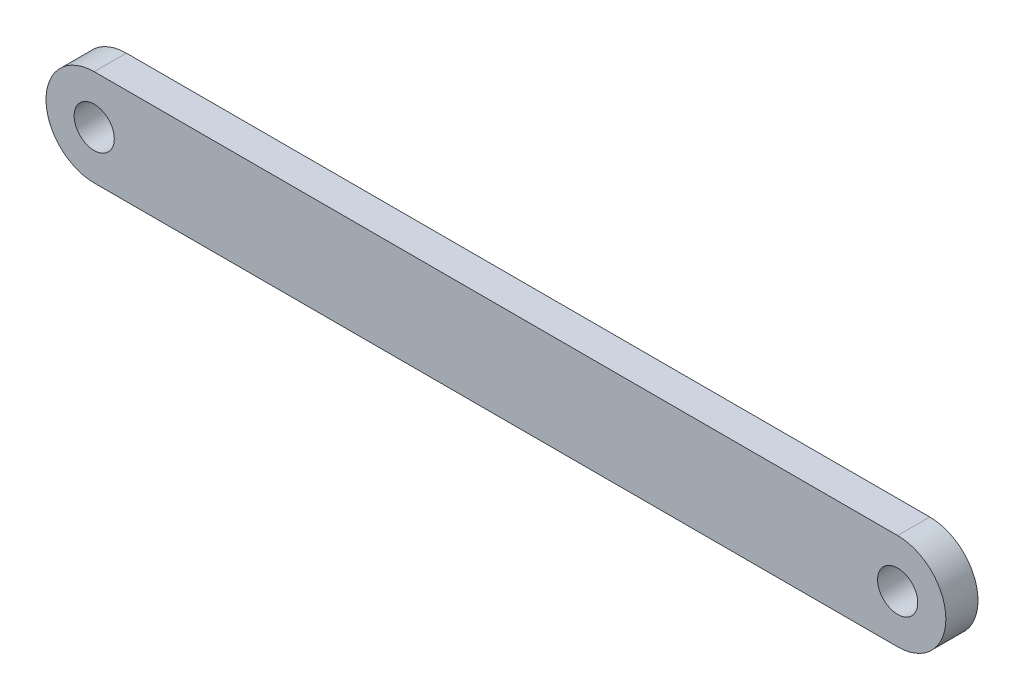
ISO-10303-21;
HEADER;
FILE_DESCRIPTION(('STEP AP214'),'2;1');
FILE_NAME('part.step','',(''),(''),'','','');
FILE_SCHEMA(('AUTOMOTIVE_DESIGN { 1 0 10303 214 1 1 1 1 }'));
ENDSEC;
DATA;
#1=APPLICATION_CONTEXT('core data for automotive mechanical design processes');
#2=APPLICATION_PROTOCOL_DEFINITION('international standard','automotive_design',2000,#1);
#3=PRODUCT_CONTEXT('',#1,'mechanical');
#4=PRODUCT('Part','Part','',(#3));
#5=PRODUCT_RELATED_PRODUCT_CATEGORY('part','',(#4));
#6=PRODUCT_DEFINITION_FORMATION('','',#4);
#7=PRODUCT_DEFINITION_CONTEXT('part definition',#1,'design');
#8=PRODUCT_DEFINITION('design','',#6,#7);
#9=PRODUCT_DEFINITION_SHAPE('','',#8);
#10=(LENGTH_UNIT() NAMED_UNIT(*) SI_UNIT(.MILLI.,.METRE.));
#11=(NAMED_UNIT(*) PLANE_ANGLE_UNIT() SI_UNIT($,.RADIAN.));
#12=(NAMED_UNIT(*) SI_UNIT($,.STERADIAN.) SOLID_ANGLE_UNIT());
#13=UNCERTAINTY_MEASURE_WITH_UNIT(LENGTH_MEASURE(1.E-05),#10,'distance_accuracy_value','');
#14=(GEOMETRIC_REPRESENTATION_CONTEXT(3) GLOBAL_UNCERTAINTY_ASSIGNED_CONTEXT((#13)) GLOBAL_UNIT_ASSIGNED_CONTEXT((#10,
#11,#12)) REPRESENTATION_CONTEXT('',''));
#15=CARTESIAN_POINT('',(0.,0.,0.));
#16=DIRECTION('',(0.,0.,1.));
#17=DIRECTION('',(1.,0.,0.));
#18=AXIS2_PLACEMENT_3D('',#15,#16,#17);
#19=CARTESIAN_POINT('',(-50.,0.,4.));
#20=DIRECTION('',(0.,0.,1.));
#21=DIRECTION('',(1.,0.,0.));
#22=AXIS2_PLACEMENT_3D('',#19,#20,#21);
#23=PLANE('',#22);
#24=CARTESIAN_POINT('',(-50.,0.,4.));
#25=DIRECTION('',(0.,0.,1.));
#26=DIRECTION('',(1.,0.,0.));
#27=AXIS2_PLACEMENT_3D('',#24,#25,#26);
#28=CIRCLE('',#27,2.49999999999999);
#29=CARTESIAN_POINT('',(-47.5,0.,4.));
#30=VERTEX_POINT('',#29);
#31=EDGE_CURVE('E102',#30,#30,#28,.T.);
#32=ORIENTED_EDGE('',*,*,#31,.F.);
#33=EDGE_LOOP('',(#32));
#34=FACE_BOUND('',#33,.T.);
#35=CARTESIAN_POINT('',(-50.,0.,4.));
#36=DIRECTION('',(0.,0.,1.));
#37=DIRECTION('',(1.,0.,0.));
#38=AXIS2_PLACEMENT_3D('',#35,#36,#37);
#39=CIRCLE('',#38,6.);
#40=CARTESIAN_POINT('',(-50.,6.,4.));
#41=VERTEX_POINT('',#40);
#42=CARTESIAN_POINT('',(-50.,-6.,4.));
#43=VERTEX_POINT('',#42);
#44=EDGE_CURVE('E87',#41,#43,#39,.T.);
#45=ORIENTED_EDGE('',*,*,#44,.T.);
#46=DIRECTION('',(1.,0.,0.));
#47=VECTOR('',#46,1.);
#48=CARTESIAN_POINT('',(-50.,-6.,4.));
#49=LINE('',#48,#47);
#50=CARTESIAN_POINT('',(50.,-5.99999999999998,4.));
#51=VERTEX_POINT('',#50);
#52=EDGE_CURVE('E82',#43,#51,#49,.T.);
#53=ORIENTED_EDGE('',*,*,#52,.T.);
#54=CARTESIAN_POINT('',(50.,0.,4.));
#55=DIRECTION('',(0.,0.,1.));
#56=DIRECTION('',(1.,0.,0.));
#57=AXIS2_PLACEMENT_3D('',#54,#55,#56);
#58=CIRCLE('',#57,6.);
#59=CARTESIAN_POINT('',(50.,6.00000000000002,4.));
#60=VERTEX_POINT('',#59);
#61=EDGE_CURVE('E85',#51,#60,#58,.T.);
#62=ORIENTED_EDGE('',*,*,#61,.T.);
#63=DIRECTION('',(-1.,0.,0.));
#64=VECTOR('',#63,1.);
#65=CARTESIAN_POINT('',(-50.,6.,4.));
#66=LINE('',#65,#64);
#67=EDGE_CURVE('E52',#60,#41,#66,.T.);
#68=ORIENTED_EDGE('',*,*,#67,.T.);
#69=EDGE_LOOP('',(#45,#53,#62,#68));
#70=FACE_BOUND('',#69,.T.);
#71=CARTESIAN_POINT('',(50.,0.,4.));
#72=DIRECTION('',(0.,0.,1.));
#73=DIRECTION('',(1.,0.,0.));
#74=AXIS2_PLACEMENT_3D('',#71,#72,#73);
#75=CIRCLE('',#74,2.5);
#76=CARTESIAN_POINT('',(52.5,0.,4.));
#77=VERTEX_POINT('',#76);
#78=EDGE_CURVE('E117',#77,#77,#75,.T.);
#79=ORIENTED_EDGE('',*,*,#78,.F.);
#80=EDGE_LOOP('',(#79));
#81=FACE_BOUND('',#80,.T.);
#82=ADVANCED_FACE('F35',(#34,#70,#81),#23,.T.);
#83=CARTESIAN_POINT('',(-50.,0.,0.));
#84=DIRECTION('',(0.,0.,1.));
#85=DIRECTION('',(1.,0.,0.));
#86=AXIS2_PLACEMENT_3D('',#83,#84,#85);
#87=PLANE('',#86);
#88=CARTESIAN_POINT('',(-50.,0.,0.));
#89=DIRECTION('',(0.,0.,1.));
#90=DIRECTION('',(1.,0.,0.));
#91=AXIS2_PLACEMENT_3D('',#88,#89,#90);
#92=CIRCLE('',#91,2.49999999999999);
#93=CARTESIAN_POINT('',(-47.5,0.,0.));
#94=VERTEX_POINT('',#93);
#95=EDGE_CURVE('E114',#94,#94,#92,.T.);
#96=ORIENTED_EDGE('',*,*,#95,.T.);
#97=EDGE_LOOP('',(#96));
#98=FACE_BOUND('',#97,.T.);
#99=CARTESIAN_POINT('',(-50.,0.,0.));
#100=DIRECTION('',(0.,0.,1.));
#101=DIRECTION('',(1.,0.,0.));
#102=AXIS2_PLACEMENT_3D('',#99,#100,#101);
#103=CIRCLE('',#102,6.);
#104=CARTESIAN_POINT('',(-50.,6.,0.));
#105=VERTEX_POINT('',#104);
#106=CARTESIAN_POINT('',(-50.,-6.,0.));
#107=VERTEX_POINT('',#106);
#108=EDGE_CURVE('E99',#105,#107,#103,.T.);
#109=ORIENTED_EDGE('',*,*,#108,.F.);
#110=DIRECTION('',(-1.,0.,0.));
#111=VECTOR('',#110,1.);
#112=CARTESIAN_POINT('',(-50.,6.,0.));
#113=LINE('',#112,#111);
#114=CARTESIAN_POINT('',(50.,6.00000000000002,0.));
#115=VERTEX_POINT('',#114);
#116=EDGE_CURVE('E75',#115,#105,#113,.T.);
#117=ORIENTED_EDGE('',*,*,#116,.F.);
#118=CARTESIAN_POINT('',(50.,0.,0.));
#119=DIRECTION('',(0.,0.,1.));
#120=DIRECTION('',(1.,0.,0.));
#121=AXIS2_PLACEMENT_3D('',#118,#119,#120);
#122=CIRCLE('',#121,6.);
#123=CARTESIAN_POINT('',(50.,-5.99999999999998,0.));
#124=VERTEX_POINT('',#123);
#125=EDGE_CURVE('E69',#124,#115,#122,.T.);
#126=ORIENTED_EDGE('',*,*,#125,.F.);
#127=DIRECTION('',(1.,0.,0.));
#128=VECTOR('',#127,1.);
#129=CARTESIAN_POINT('',(-50.,-6.,0.));
#130=LINE('',#129,#128);
#131=EDGE_CURVE('E91',#107,#124,#130,.T.);
#132=ORIENTED_EDGE('',*,*,#131,.F.);
#133=EDGE_LOOP('',(#109,#117,#126,#132));
#134=FACE_BOUND('',#133,.T.);
#135=CARTESIAN_POINT('',(50.,0.,0.));
#136=DIRECTION('',(0.,0.,1.));
#137=DIRECTION('',(1.,0.,0.));
#138=AXIS2_PLACEMENT_3D('',#135,#136,#137);
#139=CIRCLE('',#138,2.5);
#140=CARTESIAN_POINT('',(52.5,0.,0.));
#141=VERTEX_POINT('',#140);
#142=EDGE_CURVE('E120',#141,#141,#139,.T.);
#143=ORIENTED_EDGE('',*,*,#142,.T.);
#144=EDGE_LOOP('',(#143));
#145=FACE_BOUND('',#144,.T.);
#146=ADVANCED_FACE('F110',(#98,#134,#145),#87,.F.);
#147=CARTESIAN_POINT('',(-50.,0.,4.));
#148=DIRECTION('',(0.,0.,-1.));
#149=DIRECTION('',(-1.,0.,0.));
#150=AXIS2_PLACEMENT_3D('',#147,#148,#149);
#151=CYLINDRICAL_SURFACE('',#150,6.);
#152=ORIENTED_EDGE('',*,*,#108,.T.);
#153=DIRECTION('',(0.,0.,-1.));
#154=VECTOR('',#153,1.);
#155=CARTESIAN_POINT('',(-50.,-6.,4.));
#156=LINE('',#155,#154);
#157=EDGE_CURVE('E11',#43,#107,#156,.T.);
#158=ORIENTED_EDGE('',*,*,#157,.F.);
#159=ORIENTED_EDGE('',*,*,#44,.F.);
#160=DIRECTION('',(0.,0.,-1.));
#161=VECTOR('',#160,1.);
#162=CARTESIAN_POINT('',(-50.,6.,4.));
#163=LINE('',#162,#161);
#164=EDGE_CURVE('E95',#41,#105,#163,.T.);
#165=ORIENTED_EDGE('',*,*,#164,.T.);
#166=EDGE_LOOP('',(#152,#158,#159,#165));
#167=FACE_BOUND('',#166,.T.);
#168=ADVANCED_FACE('F37',(#167),#151,.T.);
#169=CARTESIAN_POINT('',(-50.,-6.,4.));
#170=DIRECTION('',(0.,1.,0.));
#171=DIRECTION('',(-1.,0.,0.));
#172=AXIS2_PLACEMENT_3D('',#169,#170,#171);
#173=PLANE('',#172);
#174=ORIENTED_EDGE('',*,*,#131,.T.);
#175=DIRECTION('',(0.,0.,-1.));
#176=VECTOR('',#175,1.);
#177=CARTESIAN_POINT('',(50.,-5.99999999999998,4.));
#178=LINE('',#177,#176);
#179=EDGE_CURVE('E44',#51,#124,#178,.T.);
#180=ORIENTED_EDGE('',*,*,#179,.F.);
#181=ORIENTED_EDGE('',*,*,#52,.F.);
#182=ORIENTED_EDGE('',*,*,#157,.T.);
#183=EDGE_LOOP('',(#174,#180,#181,#182));
#184=FACE_BOUND('',#183,.T.);
#185=ADVANCED_FACE('F90',(#184),#173,.F.);
#186=CARTESIAN_POINT('',(50.,0.,4.));
#187=DIRECTION('',(0.,0.,-1.));
#188=DIRECTION('',(-1.,0.,0.));
#189=AXIS2_PLACEMENT_3D('',#186,#187,#188);
#190=CYLINDRICAL_SURFACE('',#189,6.);
#191=ORIENTED_EDGE('',*,*,#125,.T.);
#192=DIRECTION('',(0.,0.,-1.));
#193=VECTOR('',#192,1.);
#194=CARTESIAN_POINT('',(50.,6.00000000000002,4.));
#195=LINE('',#194,#193);
#196=EDGE_CURVE('E92',#60,#115,#195,.T.);
#197=ORIENTED_EDGE('',*,*,#196,.F.);
#198=ORIENTED_EDGE('',*,*,#61,.F.);
#199=ORIENTED_EDGE('',*,*,#179,.T.);
#200=EDGE_LOOP('',(#191,#197,#198,#199));
#201=FACE_BOUND('',#200,.T.);
#202=ADVANCED_FACE('F93',(#201),#190,.T.);
#203=CARTESIAN_POINT('',(-50.,6.,4.));
#204=DIRECTION('',(0.,-1.,0.));
#205=DIRECTION('',(1.,0.,0.));
#206=AXIS2_PLACEMENT_3D('',#203,#204,#205);
#207=PLANE('',#206);
#208=ORIENTED_EDGE('',*,*,#116,.T.);
#209=ORIENTED_EDGE('',*,*,#164,.F.);
#210=ORIENTED_EDGE('',*,*,#67,.F.);
#211=ORIENTED_EDGE('',*,*,#196,.T.);
#212=EDGE_LOOP('',(#208,#209,#210,#211));
#213=FACE_BOUND('',#212,.T.);
#214=ADVANCED_FACE('F107',(#213),#207,.F.);
#215=CARTESIAN_POINT('',(-50.,0.,4.));
#216=DIRECTION('',(0.,0.,-1.));
#217=DIRECTION('',(-1.,0.,0.));
#218=AXIS2_PLACEMENT_3D('',#215,#216,#217);
#219=CYLINDRICAL_SURFACE('',#218,2.49999999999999);
#220=ORIENTED_EDGE('',*,*,#31,.T.);
#221=EDGE_LOOP('',(#220));
#222=FACE_BOUND('',#221,.T.);
#223=ORIENTED_EDGE('',*,*,#95,.F.);
#224=EDGE_LOOP('',(#223));
#225=FACE_BOUND('',#224,.T.);
#226=ADVANCED_FACE('F138',(#222,#225),#219,.F.);
#227=CARTESIAN_POINT('',(50.,0.,4.));
#228=DIRECTION('',(0.,0.,-1.));
#229=DIRECTION('',(-1.,0.,0.));
#230=AXIS2_PLACEMENT_3D('',#227,#228,#229);
#231=CYLINDRICAL_SURFACE('',#230,2.5);
#232=ORIENTED_EDGE('',*,*,#78,.T.);
#233=EDGE_LOOP('',(#232));
#234=FACE_BOUND('',#233,.T.);
#235=ORIENTED_EDGE('',*,*,#142,.F.);
#236=EDGE_LOOP('',(#235));
#237=FACE_BOUND('',#236,.T.);
#238=ADVANCED_FACE('F126',(#234,#237),#231,.F.);
#239=CLOSED_SHELL('',(#82,#146,#168,#185,#202,#214,#226,#238));
#240=MANIFOLD_SOLID_BREP('B2',#239);
#241=ADVANCED_BREP_SHAPE_REPRESENTATION('',(#18,#240),#14);
#242=SHAPE_DEFINITION_REPRESENTATION(#9,#241);
ENDSEC;
END-ISO-10303-21;
